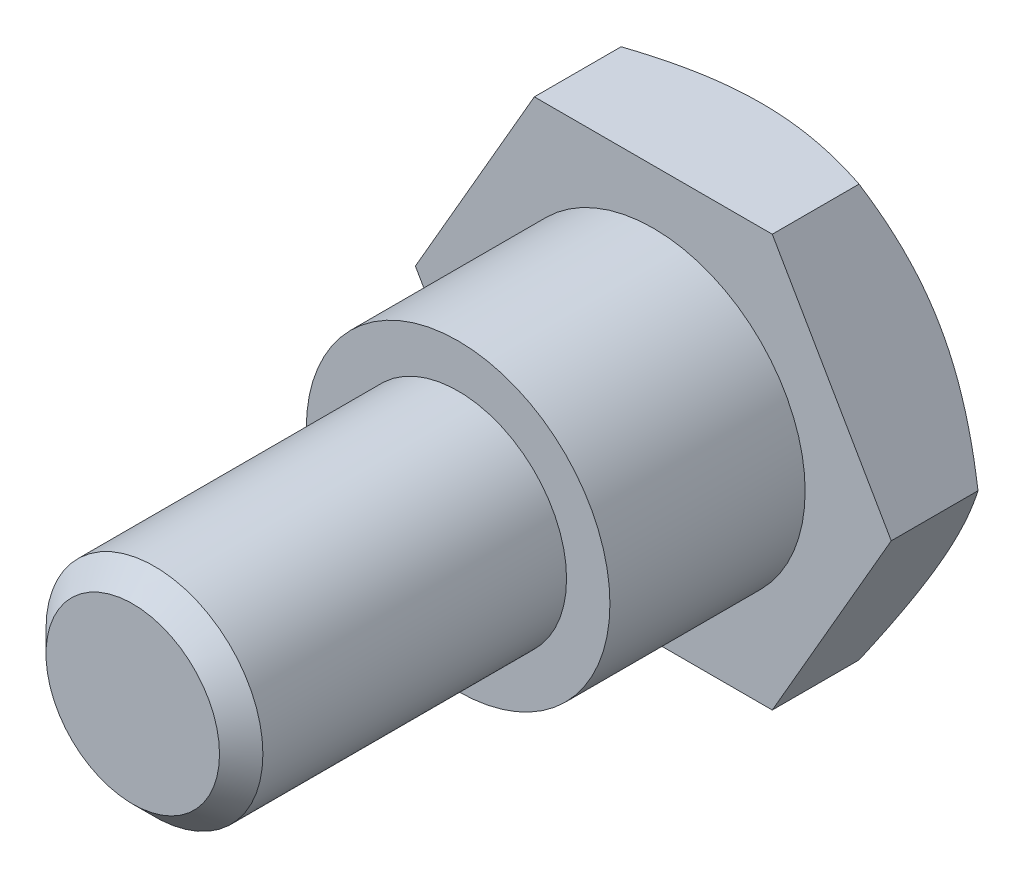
ISO-10303-21;
HEADER;
FILE_DESCRIPTION(('STEP AP214'),'2;1');
FILE_NAME('part.step','',(''),(''),'','','');
FILE_SCHEMA(('AUTOMOTIVE_DESIGN { 1 0 10303 214 1 1 1 1 }'));
ENDSEC;
DATA;
#1=APPLICATION_CONTEXT('core data for automotive mechanical design processes');
#2=APPLICATION_PROTOCOL_DEFINITION('international standard','automotive_design',2000,#1);
#3=PRODUCT_CONTEXT('',#1,'mechanical');
#4=PRODUCT('Part','Part','',(#3));
#5=PRODUCT_RELATED_PRODUCT_CATEGORY('part','',(#4));
#6=PRODUCT_DEFINITION_FORMATION('','',#4);
#7=PRODUCT_DEFINITION_CONTEXT('part definition',#1,'design');
#8=PRODUCT_DEFINITION('design','',#6,#7);
#9=PRODUCT_DEFINITION_SHAPE('','',#8);
#10=(LENGTH_UNIT() NAMED_UNIT(*) SI_UNIT(.MILLI.,.METRE.));
#11=(NAMED_UNIT(*) PLANE_ANGLE_UNIT() SI_UNIT($,.RADIAN.));
#12=(NAMED_UNIT(*) SI_UNIT($,.STERADIAN.) SOLID_ANGLE_UNIT());
#13=UNCERTAINTY_MEASURE_WITH_UNIT(LENGTH_MEASURE(1.E-05),#10,'distance_accuracy_value','');
#14=(GEOMETRIC_REPRESENTATION_CONTEXT(3) GLOBAL_UNCERTAINTY_ASSIGNED_CONTEXT((#13)) GLOBAL_UNIT_ASSIGNED_CONTEXT((#10,
#11,#12)) REPRESENTATION_CONTEXT('',''));
#15=CARTESIAN_POINT('',(0.,0.,0.));
#16=DIRECTION('',(0.,0.,1.));
#17=DIRECTION('',(1.,0.,0.));
#18=AXIS2_PLACEMENT_3D('',#15,#16,#17);
#19=CARTESIAN_POINT('',(5.48482755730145,9.5,29.));
#20=DIRECTION('',(0.,-1.,0.));
#21=DIRECTION('',(1.,0.,0.));
#22=AXIS2_PLACEMENT_3D('',#19,#20,#21);
#23=PLANE('',#22);
#24=CARTESIAN_POINT('',(-13.7339424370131,9.49999999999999,4.8198541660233));
#25=CARTESIAN_POINT('',(-13.5436192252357,9.49999999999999,4.71550593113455));
#26=CARTESIAN_POINT('',(-13.3530021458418,9.49999999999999,4.6116939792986));
#27=CARTESIAN_POINT('',(-12.9711213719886,9.49999999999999,4.40526059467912));
#28=CARTESIAN_POINT('',(-12.7798576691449,9.49999999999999,4.30263917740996));
#29=CARTESIAN_POINT('',(-12.2049445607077,9.49999999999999,3.99670383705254));
#30=CARTESIAN_POINT('',(-11.8202438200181,9.49999999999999,3.79535768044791));
#31=CARTESIAN_POINT('',(-11.0450909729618,9.49999999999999,3.39788198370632));
#32=CARTESIAN_POINT('',(-10.6546179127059,9.5,3.20179320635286));
#33=CARTESIAN_POINT('',(-9.86968730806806,9.5,2.81778716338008));
#34=CARTESIAN_POINT('',(-9.47522999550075,9.5,2.62986942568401));
#35=CARTESIAN_POINT('',(-8.67449029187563,9.5,2.26105592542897));
#36=CARTESIAN_POINT('',(-8.2681224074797,9.5,2.08034477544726));
#37=CARTESIAN_POINT('',(-7.44952568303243,9.5,1.73248678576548));
#38=CARTESIAN_POINT('',(-7.03729614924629,9.5,1.56534156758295));
#39=CARTESIAN_POINT('',(-6.20706952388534,9.5,1.24884915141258));
#40=CARTESIAN_POINT('',(-5.78908780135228,9.5,1.09946207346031));
#41=CARTESIAN_POINT('',(-4.94591208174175,9.5,0.822950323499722));
#42=CARTESIAN_POINT('',(-4.52072054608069,9.5,0.695818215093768));
#43=CARTESIAN_POINT('',(-3.62800538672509,9.5,0.460424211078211));
#44=CARTESIAN_POINT('',(-3.15983959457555,9.5,0.354520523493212));
#45=CARTESIAN_POINT('',(-2.45211687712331,9.5,0.226051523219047));
#46=CARTESIAN_POINT('',(-2.21527591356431,9.5,0.188290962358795));
#47=CARTESIAN_POINT('',(-1.74011644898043,9.5,0.123733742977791));
#48=CARTESIAN_POINT('',(-1.50179815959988,9.5,0.0969355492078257));
#49=CARTESIAN_POINT('',(-1.02623033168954,9.5,0.0551538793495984));
#50=CARTESIAN_POINT('',(-0.788989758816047,9.5,0.0400688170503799));
#51=CARTESIAN_POINT('',(-0.314051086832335,9.5,0.021718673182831));
#52=CARTESIAN_POINT('',(-0.0763529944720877,9.5,0.0184534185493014));
#53=CARTESIAN_POINT('',(0.398860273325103,9.5,0.023831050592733));
#54=CARTESIAN_POINT('',(0.636375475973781,9.5,0.0324715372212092));
#55=CARTESIAN_POINT('',(1.11069159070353,9.5,0.0614237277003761));
#56=CARTESIAN_POINT('',(1.34749247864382,9.5,0.0817358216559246));
#57=CARTESIAN_POINT('',(1.86592634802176,9.5,0.138570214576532));
#58=CARTESIAN_POINT('',(2.1472989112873,9.5,0.177480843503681));
#59=CARTESIAN_POINT('',(2.70760424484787,9.5,0.269951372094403));
#60=CARTESIAN_POINT('',(2.98653680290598,9.5,0.323512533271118));
#61=CARTESIAN_POINT('',(3.81998578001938,9.5,0.504060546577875));
#62=CARTESIAN_POINT('',(4.37028311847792,9.5,0.650807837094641));
#63=CARTESIAN_POINT('',(5.19305542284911,9.5,0.902817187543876));
#64=CARTESIAN_POINT('',(5.47024842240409,9.5,0.993451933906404));
#65=CARTESIAN_POINT('',(6.02159618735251,9.5,1.18368159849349));
#66=CARTESIAN_POINT('',(6.29575067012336,9.5,1.28327734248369));
#67=CARTESIAN_POINT('',(6.83981458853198,9.5,1.48955006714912));
#68=CARTESIAN_POINT('',(7.10973827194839,9.5,1.59618980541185));
#69=CARTESIAN_POINT('',(7.64686899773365,9.5,1.81585567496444));
#70=CARTESIAN_POINT('',(7.91407695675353,9.5,1.92887956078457));
#71=CARTESIAN_POINT('',(8.18010052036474,9.5,2.04456890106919));
#72=B_SPLINE_CURVE_WITH_KNOTS('',3,(#24,#25,#26,#27,#28,#29,#30,#31,#32,#33,#34,#35,#36,#37,#38,
#39,#40,#41,#42,#43,#44,#45,#46,#47,#48,#49,#50,#51,#52,#53,#54,#55,#56,#57,#58,#59,#60,#61,#62,
#63,#64,#65,#66,#67,#68,#69,#70,#71),.UNSPECIFIED.,.F.,.F.,(4,2,2,2,2,2,2,2,2,2,2,2,2,2,2,2,2,2,
2,2,2,2,2,4),(0.,0.651153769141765,1.30231601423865,2.60488241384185,3.91563929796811,
5.22632035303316,6.56033932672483,7.8945175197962,9.22564052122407,10.5563178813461,
11.9946319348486,12.7139153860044,13.4330980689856,14.1459714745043,14.8588344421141,
15.5715537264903,16.2842968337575,17.1359996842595,17.9877758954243,19.6939467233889,
20.5687632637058,21.4436605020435,22.3142541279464,23.1845434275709),.UNSPECIFIED.);
#73=CARTESIAN_POINT('',(-5.48482755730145,9.5,1.));
#74=VERTEX_POINT('',#73);
#75=CARTESIAN_POINT('',(5.48482755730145,9.5,1.));
#76=VERTEX_POINT('',#75);
#77=EDGE_CURVE('E53',#74,#76,#72,.T.);
#78=ORIENTED_EDGE('',*,*,#77,.F.);
#79=DIRECTION('',(0.,0.,-1.));
#80=VECTOR('',#79,1.);
#81=CARTESIAN_POINT('',(-5.48482755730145,9.5,29.));
#82=LINE('',#81,#80);
#83=CARTESIAN_POINT('',(-5.48482755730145,9.5,5.));
#84=VERTEX_POINT('',#83);
#85=EDGE_CURVE('E123',#84,#74,#82,.T.);
#86=ORIENTED_EDGE('',*,*,#85,.F.);
#87=DIRECTION('',(1.,0.,0.));
#88=VECTOR('',#87,1.);
#89=CARTESIAN_POINT('',(5.48482755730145,9.5,5.));
#90=LINE('',#89,#88);
#91=CARTESIAN_POINT('',(5.48482755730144,9.5,5.));
#92=VERTEX_POINT('',#91);
#93=EDGE_CURVE('E114',#84,#92,#90,.T.);
#94=ORIENTED_EDGE('',*,*,#93,.T.);
#95=DIRECTION('',(0.,0.,-1.));
#96=VECTOR('',#95,1.);
#97=CARTESIAN_POINT('',(5.48482755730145,9.5,29.));
#98=LINE('',#97,#96);
#99=EDGE_CURVE('E110',#92,#76,#98,.T.);
#100=ORIENTED_EDGE('',*,*,#99,.T.);
#101=EDGE_LOOP('',(#78,#86,#94,#100));
#102=FACE_BOUND('',#101,.T.);
#103=ADVANCED_FACE('F38',(#102),#23,.F.);
#104=CARTESIAN_POINT('',(-5.48482755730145,9.5,29.));
#105=DIRECTION('',(0.866025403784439,-0.5,0.));
#106=DIRECTION('',(0.5,0.866025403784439,0.));
#107=AXIS2_PLACEMENT_3D('',#104,#105,#106);
#108=PLANE('',#107);
#109=CARTESIAN_POINT('',(-10.9697705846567,-0.000199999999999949,1.00007698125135));
#110=CARTESIAN_POINT('',(-10.8475130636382,0.211556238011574,0.918579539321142));
#111=CARTESIAN_POINT('',(-10.724626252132,0.424402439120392,0.840729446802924));
#112=CARTESIAN_POINT('',(-10.4775192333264,0.85240435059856,0.69343423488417));
#113=CARTESIAN_POINT('',(-10.3532982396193,1.06756142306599,0.623994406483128));
#114=CARTESIAN_POINT('',(-10.1031833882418,1.50077305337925,0.494518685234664));
#115=CARTESIAN_POINT('',(-9.97728532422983,1.71883489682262,0.434515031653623));
#116=CARTESIAN_POINT('',(-9.72434179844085,2.15694593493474,0.325436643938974));
#117=CARTESIAN_POINT('',(-9.59729668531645,2.37699452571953,0.276358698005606));
#118=CARTESIAN_POINT('',(-9.34637592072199,2.81160203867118,0.191694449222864));
#119=CARTESIAN_POINT('',(-9.22253343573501,3.0261035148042,0.155717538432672));
#120=CARTESIAN_POINT('',(-8.9741047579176,3.45639460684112,0.0959709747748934));
#121=CARTESIAN_POINT('',(-8.84951854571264,3.67218425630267,0.0722016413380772));
#122=CARTESIAN_POINT('',(-8.60011147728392,4.10416997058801,0.0375646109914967));
#123=CARTESIAN_POINT('',(-8.47529139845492,4.32036468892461,0.0266746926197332));
#124=CARTESIAN_POINT('',(-8.22554111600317,4.75294486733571,0.0180432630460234));
#125=CARTESIAN_POINT('',(-8.10061091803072,4.96933031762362,0.0203011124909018));
#126=CARTESIAN_POINT('',(-7.87127583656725,5.3665503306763,0.0364633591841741));
#127=CARTESIAN_POINT('',(-7.76683537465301,5.54744651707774,0.0484150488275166));
#128=CARTESIAN_POINT('',(-7.55830198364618,5.90863694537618,0.0812340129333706));
#129=CARTESIAN_POINT('',(-7.4542090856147,6.0889311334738,0.102102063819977));
#130=CARTESIAN_POINT('',(-7.14247471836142,6.62887089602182,0.177574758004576));
#131=CARTESIAN_POINT('',(-6.93558573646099,6.98721312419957,0.245031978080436));
#132=CARTESIAN_POINT('',(-6.51896611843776,7.70881947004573,0.411970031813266));
#133=CARTESIAN_POINT('',(-6.30932537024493,8.07192789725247,0.512317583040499));
#134=CARTESIAN_POINT('',(-5.89408460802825,8.79114599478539,0.738498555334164));
#135=CARTESIAN_POINT('',(-5.6884752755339,9.14727180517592,0.864262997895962));
#136=CARTESIAN_POINT('',(-5.48471208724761,9.5002,1.00007698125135));
#137=B_SPLINE_CURVE_WITH_KNOTS('',3,(#109,#110,#111,#112,#113,#114,#115,#116,#117,#118,#119,
#120,#121,#122,#123,#124,#125,#126,#127,#128,#129,#130,#131,#132,#133,#134,#135,#136),
.UNSPECIFIED.,.F.,.F.,(4,2,2,2,2,2,2,2,2,2,2,2,2,4),(0.,0.773249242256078,1.54698244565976,
2.32330426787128,3.09939757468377,3.84996835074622,4.60055876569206,5.34985225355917,
6.09910930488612,6.7265804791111,7.35410630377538,8.61040386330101,9.90290017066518,
11.191934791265),.UNSPECIFIED.);
#138=CARTESIAN_POINT('',(-10.9696551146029,0.,1.));
#139=VERTEX_POINT('',#138);
#140=EDGE_CURVE('E167',#139,#74,#137,.T.);
#141=ORIENTED_EDGE('',*,*,#140,.F.);
#142=DIRECTION('',(0.,0.,-1.));
#143=VECTOR('',#142,1.);
#144=CARTESIAN_POINT('',(-10.9696551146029,0.,29.));
#145=LINE('',#144,#143);
#146=CARTESIAN_POINT('',(-10.9696551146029,0.,5.));
#147=VERTEX_POINT('',#146);
#148=EDGE_CURVE('E120',#147,#139,#145,.T.);
#149=ORIENTED_EDGE('',*,*,#148,.F.);
#150=DIRECTION('',(0.5,0.866025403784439,0.));
#151=VECTOR('',#150,1.);
#152=CARTESIAN_POINT('',(-5.48482755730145,9.5,5.));
#153=LINE('',#152,#151);
#154=EDGE_CURVE('E331',#147,#84,#153,.T.);
#155=ORIENTED_EDGE('',*,*,#154,.T.);
#156=ORIENTED_EDGE('',*,*,#85,.T.);
#157=EDGE_LOOP('',(#141,#149,#155,#156));
#158=FACE_BOUND('',#157,.T.);
#159=ADVANCED_FACE('F149',(#158),#108,.F.);
#160=CARTESIAN_POINT('',(-10.9696551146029,0.,29.));
#161=DIRECTION('',(0.866025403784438,0.5,0.));
#162=DIRECTION('',(-0.5,0.866025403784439,0.));
#163=AXIS2_PLACEMENT_3D('',#160,#161,#162);
#164=PLANE('',#163);
#165=CARTESIAN_POINT('',(-5.4847120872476,-9.5002,1.00007698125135));
#166=CARTESIAN_POINT('',(-5.60696960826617,-9.28844376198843,0.918579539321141));
#167=CARTESIAN_POINT('',(-5.72985641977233,-9.07559756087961,0.840729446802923));
#168=CARTESIAN_POINT('',(-5.97696343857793,-8.64759564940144,0.693434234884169));
#169=CARTESIAN_POINT('',(-6.10118443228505,-8.43243857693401,0.623994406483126));
#170=CARTESIAN_POINT('',(-6.35129928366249,-7.99922694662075,0.494518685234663));
#171=CARTESIAN_POINT('',(-6.4771973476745,-7.78116510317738,0.434515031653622));
#172=CARTESIAN_POINT('',(-6.73014087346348,-7.34305406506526,0.325436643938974));
#173=CARTESIAN_POINT('',(-6.85718598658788,-7.12300547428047,0.276358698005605));
#174=CARTESIAN_POINT('',(-7.10810675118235,-6.68839796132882,0.191694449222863));
#175=CARTESIAN_POINT('',(-7.23194923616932,-6.4738964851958,0.155717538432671));
#176=CARTESIAN_POINT('',(-7.48037791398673,-6.04360539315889,0.0959709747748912));
#177=CARTESIAN_POINT('',(-7.60496412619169,-5.82781574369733,0.0722016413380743));
#178=CARTESIAN_POINT('',(-7.85437119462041,-5.39583002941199,0.0375646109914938));
#179=CARTESIAN_POINT('',(-7.97919127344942,-5.1796353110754,0.0266746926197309));
#180=CARTESIAN_POINT('',(-8.22894155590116,-4.7470551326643,0.018043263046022));
#181=CARTESIAN_POINT('',(-8.35387175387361,-4.53066968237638,0.0203011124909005));
#182=CARTESIAN_POINT('',(-8.58320683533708,-4.1334496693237,0.0364633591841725));
#183=CARTESIAN_POINT('',(-8.68764729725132,-3.95255348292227,0.0484150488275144));
#184=CARTESIAN_POINT('',(-8.89618068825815,-3.59136305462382,0.0812340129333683));
#185=CARTESIAN_POINT('',(-9.00027358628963,-3.41106886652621,0.102102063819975));
#186=CARTESIAN_POINT('',(-9.31200795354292,-2.87112910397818,0.177574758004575));
#187=CARTESIAN_POINT('',(-9.51889693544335,-2.51278687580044,0.245031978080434));
#188=CARTESIAN_POINT('',(-9.93551655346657,-1.79118052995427,0.411970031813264));
#189=CARTESIAN_POINT('',(-10.1451573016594,-1.42807210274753,0.512317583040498));
#190=CARTESIAN_POINT('',(-10.5603980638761,-0.708854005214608,0.738498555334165));
#191=CARTESIAN_POINT('',(-10.7660073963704,-0.352728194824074,0.864262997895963));
#192=CARTESIAN_POINT('',(-10.9697705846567,0.000199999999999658,1.00007698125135));
#193=B_SPLINE_CURVE_WITH_KNOTS('',3,(#165,#166,#167,#168,#169,#170,#171,#172,#173,#174,#175,
#176,#177,#178,#179,#180,#181,#182,#183,#184,#185,#186,#187,#188,#189,#190,#191,#192),
.UNSPECIFIED.,.F.,.F.,(4,2,2,2,2,2,2,2,2,2,2,2,2,4),(0.,0.773249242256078,1.54698244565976,
2.32330426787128,3.09939757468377,3.84996835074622,4.60055876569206,5.34985225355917,
6.09910930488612,6.7265804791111,7.35410630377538,8.61040386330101,9.90290017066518,
11.191934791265),.UNSPECIFIED.);
#194=CARTESIAN_POINT('',(-5.48482755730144,-9.5,1.));
#195=VERTEX_POINT('',#194);
#196=EDGE_CURVE('E199',#195,#139,#193,.T.);
#197=ORIENTED_EDGE('',*,*,#196,.F.);
#198=DIRECTION('',(0.,0.,-1.));
#199=VECTOR('',#198,1.);
#200=CARTESIAN_POINT('',(-5.48482755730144,-9.5,29.));
#201=LINE('',#200,#199);
#202=CARTESIAN_POINT('',(-5.48482755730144,-9.5,5.));
#203=VERTEX_POINT('',#202);
#204=EDGE_CURVE('E112',#203,#195,#201,.T.);
#205=ORIENTED_EDGE('',*,*,#204,.F.);
#206=DIRECTION('',(-0.5,0.866025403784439,0.));
#207=VECTOR('',#206,1.);
#208=CARTESIAN_POINT('',(-10.9696551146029,0.,5.));
#209=LINE('',#208,#207);
#210=EDGE_CURVE('E328',#203,#147,#209,.T.);
#211=ORIENTED_EDGE('',*,*,#210,.T.);
#212=ORIENTED_EDGE('',*,*,#148,.T.);
#213=EDGE_LOOP('',(#197,#205,#211,#212));
#214=FACE_BOUND('',#213,.T.);
#215=ADVANCED_FACE('F154',(#214),#164,.F.);
#216=CARTESIAN_POINT('',(-5.48482755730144,-9.5,29.));
#217=DIRECTION('',(0.,1.,0.));
#218=DIRECTION('',(-1.,0.,0.));
#219=AXIS2_PLACEMENT_3D('',#216,#217,#218);
#220=PLANE('',#219);
#221=CARTESIAN_POINT('',(-13.7339424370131,-9.5,4.81985416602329));
#222=CARTESIAN_POINT('',(-13.5436192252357,-9.5,4.71550593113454));
#223=CARTESIAN_POINT('',(-13.3530021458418,-9.5,4.61169397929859));
#224=CARTESIAN_POINT('',(-12.9711213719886,-9.5,4.40526059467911));
#225=CARTESIAN_POINT('',(-12.7798576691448,-9.5,4.30263917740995));
#226=CARTESIAN_POINT('',(-12.2049445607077,-9.5,3.99670383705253));
#227=CARTESIAN_POINT('',(-11.8202438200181,-9.5,3.7953576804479));
#228=CARTESIAN_POINT('',(-11.0450909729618,-9.5,3.39788198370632));
#229=CARTESIAN_POINT('',(-10.6546179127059,-9.5,3.20179320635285));
#230=CARTESIAN_POINT('',(-9.86968730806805,-9.5,2.81778716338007));
#231=CARTESIAN_POINT('',(-9.47522999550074,-9.5,2.62986942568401));
#232=CARTESIAN_POINT('',(-8.67449029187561,-9.5,2.26105592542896));
#233=CARTESIAN_POINT('',(-8.26812240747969,-9.5,2.08034477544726));
#234=CARTESIAN_POINT('',(-7.44952568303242,-9.5,1.73248678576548));
#235=CARTESIAN_POINT('',(-7.03729614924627,-9.5,1.56534156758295));
#236=CARTESIAN_POINT('',(-6.20706952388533,-9.5,1.24884915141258));
#237=CARTESIAN_POINT('',(-5.78908780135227,-9.5,1.09946207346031));
#238=CARTESIAN_POINT('',(-4.94591208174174,-9.5,0.822950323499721));
#239=CARTESIAN_POINT('',(-4.52072054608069,-9.5,0.695818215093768));
#240=CARTESIAN_POINT('',(-3.62800538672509,-9.5,0.460424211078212));
#241=CARTESIAN_POINT('',(-3.15983959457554,-9.5,0.354520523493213));
#242=CARTESIAN_POINT('',(-2.4521168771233,-9.5,0.226051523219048));
#243=CARTESIAN_POINT('',(-2.2152759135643,-9.5,0.188290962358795));
#244=CARTESIAN_POINT('',(-1.74011644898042,-9.5,0.123733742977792));
#245=CARTESIAN_POINT('',(-1.50179815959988,-9.5,0.096935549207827));
#246=CARTESIAN_POINT('',(-1.02623033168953,-9.5,0.0551538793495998));
#247=CARTESIAN_POINT('',(-0.78898975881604,-9.5,0.0400688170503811));
#248=CARTESIAN_POINT('',(-0.314051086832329,-9.5,0.0217186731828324));
#249=CARTESIAN_POINT('',(-0.0763529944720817,-9.5,0.0184534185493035));
#250=CARTESIAN_POINT('',(0.398860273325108,-9.5,0.0238310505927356));
#251=CARTESIAN_POINT('',(0.636375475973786,-9.5,0.0324715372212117));
#252=CARTESIAN_POINT('',(1.11069159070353,-9.5,0.061423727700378));
#253=CARTESIAN_POINT('',(1.34749247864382,-9.5,0.0817358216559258));
#254=CARTESIAN_POINT('',(1.86592634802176,-9.5,0.138570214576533));
#255=CARTESIAN_POINT('',(2.14729891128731,-9.5,0.177480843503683));
#256=CARTESIAN_POINT('',(2.70760424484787,-9.5,0.269951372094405));
#257=CARTESIAN_POINT('',(2.98653680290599,-9.5,0.323512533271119));
#258=CARTESIAN_POINT('',(3.81998578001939,-9.5,0.504060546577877));
#259=CARTESIAN_POINT('',(4.37028311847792,-9.5,0.650807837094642));
#260=CARTESIAN_POINT('',(5.19305542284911,-9.5,0.902817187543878));
#261=CARTESIAN_POINT('',(5.47024842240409,-9.5,0.993451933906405));
#262=CARTESIAN_POINT('',(6.02159618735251,-9.5,1.18368159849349));
#263=CARTESIAN_POINT('',(6.29575067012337,-9.5,1.28327734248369));
#264=CARTESIAN_POINT('',(6.83981458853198,-9.5,1.48955006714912));
#265=CARTESIAN_POINT('',(7.1097382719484,-9.5,1.59618980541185));
#266=CARTESIAN_POINT('',(7.64686899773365,-9.5,1.81585567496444));
#267=CARTESIAN_POINT('',(7.91407695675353,-9.5,1.92887956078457));
#268=CARTESIAN_POINT('',(8.18010052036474,-9.5,2.04456890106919));
#269=B_SPLINE_CURVE_WITH_KNOTS('',3,(#221,#222,#223,#224,#225,#226,#227,#228,#229,#230,#231,
#232,#233,#234,#235,#236,#237,#238,#239,#240,#241,#242,#243,#244,#245,#246,#247,#248,#249,#250,
#251,#252,#253,#254,#255,#256,#257,#258,#259,#260,#261,#262,#263,#264,#265,#266,#267,#268),
.UNSPECIFIED.,.F.,.F.,(4,2,2,2,2,2,2,2,2,2,2,2,2,2,2,2,2,2,2,2,2,2,2,4),(0.,0.651153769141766,
1.30231601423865,2.60488241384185,3.9156392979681,5.22632035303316,6.56033932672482,
7.89451751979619,9.22564052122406,10.556317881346,11.9946319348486,12.7139153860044,
13.4330980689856,14.1459714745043,14.8588344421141,15.5715537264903,16.2842968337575,
17.1359996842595,17.9877758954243,19.6939467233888,20.5687632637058,21.4436605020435,
22.3142541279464,23.1845434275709),.UNSPECIFIED.);
#270=CARTESIAN_POINT('',(5.48482755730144,-9.5,1.));
#271=VERTEX_POINT('',#270);
#272=EDGE_CURVE('E106',#271,#195,#269,.F.);
#273=ORIENTED_EDGE('',*,*,#272,.F.);
#274=DIRECTION('',(0.,0.,-1.));
#275=VECTOR('',#274,1.);
#276=CARTESIAN_POINT('',(5.48482755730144,-9.5,29.));
#277=LINE('',#276,#275);
#278=CARTESIAN_POINT('',(5.48482755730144,-9.5,5.));
#279=VERTEX_POINT('',#278);
#280=EDGE_CURVE('E105',#279,#271,#277,.T.);
#281=ORIENTED_EDGE('',*,*,#280,.F.);
#282=DIRECTION('',(-1.,0.,0.));
#283=VECTOR('',#282,1.);
#284=CARTESIAN_POINT('',(-5.48482755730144,-9.5,5.));
#285=LINE('',#284,#283);
#286=EDGE_CURVE('E323',#279,#203,#285,.T.);
#287=ORIENTED_EDGE('',*,*,#286,.T.);
#288=ORIENTED_EDGE('',*,*,#204,.T.);
#289=EDGE_LOOP('',(#273,#281,#287,#288));
#290=FACE_BOUND('',#289,.T.);
#291=ADVANCED_FACE('F206',(#290),#220,.F.);
#292=CARTESIAN_POINT('',(5.48482755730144,-9.5,29.));
#293=DIRECTION('',(-0.866025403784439,0.5,0.));
#294=DIRECTION('',(-0.5,-0.866025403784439,0.));
#295=AXIS2_PLACEMENT_3D('',#292,#293,#294);
#296=PLANE('',#295);
#297=CARTESIAN_POINT('',(10.9697705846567,0.000200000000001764,1.00007698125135));
#298=CARTESIAN_POINT('',(10.8475130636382,-0.211556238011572,0.918579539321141));
#299=CARTESIAN_POINT('',(10.724626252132,-0.424402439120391,0.840729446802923));
#300=CARTESIAN_POINT('',(10.4775192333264,-0.852404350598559,0.693434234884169));
#301=CARTESIAN_POINT('',(10.3532982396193,-1.06756142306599,0.623994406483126));
#302=CARTESIAN_POINT('',(10.1031833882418,-1.50077305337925,0.494518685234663));
#303=CARTESIAN_POINT('',(9.97728532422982,-1.71883489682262,0.434515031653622));
#304=CARTESIAN_POINT('',(9.72434179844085,-2.15694593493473,0.325436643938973));
#305=CARTESIAN_POINT('',(9.59729668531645,-2.37699452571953,0.276358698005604));
#306=CARTESIAN_POINT('',(9.34637592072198,-2.81160203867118,0.191694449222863));
#307=CARTESIAN_POINT('',(9.22253343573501,-3.0261035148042,0.155717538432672));
#308=CARTESIAN_POINT('',(8.9741047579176,-3.45639460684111,0.0959709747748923));
#309=CARTESIAN_POINT('',(8.84951854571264,-3.67218425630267,0.0722016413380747));
#310=CARTESIAN_POINT('',(8.60011147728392,-4.10416997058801,0.037564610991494));
#311=CARTESIAN_POINT('',(8.47529139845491,-4.3203646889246,0.0266746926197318));
#312=CARTESIAN_POINT('',(8.22554111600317,-4.7529448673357,0.0180432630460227));
#313=CARTESIAN_POINT('',(8.10061091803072,-4.96933031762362,0.0203011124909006));
#314=CARTESIAN_POINT('',(7.87127583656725,-5.3665503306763,0.0364633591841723));
#315=CARTESIAN_POINT('',(7.766835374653,-5.54744651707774,0.0484150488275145));
#316=CARTESIAN_POINT('',(7.55830198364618,-5.90863694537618,0.0812340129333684));
#317=CARTESIAN_POINT('',(7.4542090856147,-6.0889311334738,0.102102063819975));
#318=CARTESIAN_POINT('',(7.14247471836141,-6.62887089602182,0.177574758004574));
#319=CARTESIAN_POINT('',(6.93558573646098,-6.98721312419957,0.245031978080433));
#320=CARTESIAN_POINT('',(6.51896611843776,-7.70881947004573,0.411970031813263));
#321=CARTESIAN_POINT('',(6.30932537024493,-8.07192789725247,0.512317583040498));
#322=CARTESIAN_POINT('',(5.89408460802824,-8.79114599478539,0.738498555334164));
#323=CARTESIAN_POINT('',(5.68847527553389,-9.14727180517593,0.864262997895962));
#324=CARTESIAN_POINT('',(5.4847120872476,-9.5002,1.00007698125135));
#325=B_SPLINE_CURVE_WITH_KNOTS('',3,(#297,#298,#299,#300,#301,#302,#303,#304,#305,#306,#307,
#308,#309,#310,#311,#312,#313,#314,#315,#316,#317,#318,#319,#320,#321,#322,#323,#324),
.UNSPECIFIED.,.F.,.F.,(4,2,2,2,2,2,2,2,2,2,2,2,2,4),(0.,0.773249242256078,1.54698244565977,
2.32330426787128,3.09939757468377,3.84996835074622,4.60055876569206,5.34985225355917,
6.09910930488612,6.7265804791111,7.35410630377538,8.61040386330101,9.90290017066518,
11.191934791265),.UNSPECIFIED.);
#326=CARTESIAN_POINT('',(10.9696551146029,0.,1.));
#327=VERTEX_POINT('',#326);
#328=EDGE_CURVE('E91',#327,#271,#325,.T.);
#329=ORIENTED_EDGE('',*,*,#328,.F.);
#330=DIRECTION('',(0.,0.,-1.));
#331=VECTOR('',#330,1.);
#332=CARTESIAN_POINT('',(10.9696551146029,0.,29.));
#333=LINE('',#332,#331);
#334=CARTESIAN_POINT('',(10.9696551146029,0.,5.00000000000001));
#335=VERTEX_POINT('',#334);
#336=EDGE_CURVE('E103',#335,#327,#333,.T.);
#337=ORIENTED_EDGE('',*,*,#336,.F.);
#338=DIRECTION('',(-0.5,-0.866025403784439,0.));
#339=VECTOR('',#338,1.);
#340=CARTESIAN_POINT('',(5.48482755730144,-9.5,5.));
#341=LINE('',#340,#339);
#342=EDGE_CURVE('E61',#335,#279,#341,.T.);
#343=ORIENTED_EDGE('',*,*,#342,.T.);
#344=ORIENTED_EDGE('',*,*,#280,.T.);
#345=EDGE_LOOP('',(#329,#337,#343,#344));
#346=FACE_BOUND('',#345,.T.);
#347=ADVANCED_FACE('F102',(#346),#296,.F.);
#348=CARTESIAN_POINT('',(10.9696551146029,0.,29.));
#349=DIRECTION('',(-0.866025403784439,-0.5,0.));
#350=DIRECTION('',(0.5,-0.866025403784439,0.));
#351=AXIS2_PLACEMENT_3D('',#348,#349,#350);
#352=PLANE('',#351);
#353=CARTESIAN_POINT('',(5.48471208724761,9.5002,1.00007698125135));
#354=CARTESIAN_POINT('',(5.60696960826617,9.28844376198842,0.91857953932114));
#355=CARTESIAN_POINT('',(5.72985641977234,9.07559756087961,0.840729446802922));
#356=CARTESIAN_POINT('',(5.97696343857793,8.64759564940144,0.693434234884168));
#357=CARTESIAN_POINT('',(6.10118443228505,8.43243857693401,0.623994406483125));
#358=CARTESIAN_POINT('',(6.35129928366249,7.99922694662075,0.494518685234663));
#359=CARTESIAN_POINT('',(6.47719734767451,7.78116510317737,0.434515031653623));
#360=CARTESIAN_POINT('',(6.73014087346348,7.34305406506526,0.325436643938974));
#361=CARTESIAN_POINT('',(6.85718598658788,7.12300547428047,0.276358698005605));
#362=CARTESIAN_POINT('',(7.10810675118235,6.68839796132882,0.191694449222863));
#363=CARTESIAN_POINT('',(7.23194923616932,6.4738964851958,0.155717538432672));
#364=CARTESIAN_POINT('',(7.48037791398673,6.04360539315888,0.0959709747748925));
#365=CARTESIAN_POINT('',(7.6049641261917,5.82781574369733,0.0722016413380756));
#366=CARTESIAN_POINT('',(7.85437119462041,5.39583002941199,0.0375646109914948));
#367=CARTESIAN_POINT('',(7.97919127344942,5.17963531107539,0.0266746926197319));
#368=CARTESIAN_POINT('',(8.22894155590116,4.74705513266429,0.0180432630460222));
#369=CARTESIAN_POINT('',(8.35387175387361,4.53066968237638,0.0203011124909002));
#370=CARTESIAN_POINT('',(8.58320683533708,4.1334496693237,0.0364633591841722));
#371=CARTESIAN_POINT('',(8.68764729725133,3.95255348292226,0.0484150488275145));
#372=CARTESIAN_POINT('',(8.89618068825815,3.59136305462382,0.0812340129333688));
#373=CARTESIAN_POINT('',(9.00027358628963,3.4110688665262,0.102102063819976));
#374=CARTESIAN_POINT('',(9.31200795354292,2.87112910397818,0.177574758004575));
#375=CARTESIAN_POINT('',(9.51889693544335,2.51278687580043,0.245031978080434));
#376=CARTESIAN_POINT('',(9.93551655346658,1.79118052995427,0.411970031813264));
#377=CARTESIAN_POINT('',(10.1451573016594,1.42807210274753,0.512317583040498));
#378=CARTESIAN_POINT('',(10.5603980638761,0.708854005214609,0.738498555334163));
#379=CARTESIAN_POINT('',(10.7660073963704,0.352728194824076,0.864262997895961));
#380=CARTESIAN_POINT('',(10.9697705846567,-0.000199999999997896,1.00007698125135));
#381=B_SPLINE_CURVE_WITH_KNOTS('',3,(#353,#354,#355,#356,#357,#358,#359,#360,#361,#362,#363,
#364,#365,#366,#367,#368,#369,#370,#371,#372,#373,#374,#375,#376,#377,#378,#379,#380),
.UNSPECIFIED.,.F.,.F.,(4,2,2,2,2,2,2,2,2,2,2,2,2,4),(0.,0.773249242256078,1.54698244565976,
2.32330426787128,3.09939757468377,3.84996835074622,4.60055876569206,5.34985225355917,
6.09910930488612,6.7265804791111,7.35410630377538,8.61040386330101,9.90290017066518,
11.191934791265),.UNSPECIFIED.);
#382=EDGE_CURVE('E88',#76,#327,#381,.T.);
#383=ORIENTED_EDGE('',*,*,#382,.F.);
#384=ORIENTED_EDGE('',*,*,#99,.F.);
#385=DIRECTION('',(0.5,-0.866025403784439,0.));
#386=VECTOR('',#385,1.);
#387=CARTESIAN_POINT('',(10.9696551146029,0.,5.));
#388=LINE('',#387,#386);
#389=EDGE_CURVE('E109',#92,#335,#388,.T.);
#390=ORIENTED_EDGE('',*,*,#389,.T.);
#391=ORIENTED_EDGE('',*,*,#336,.T.);
#392=EDGE_LOOP('',(#383,#384,#390,#391));
#393=FACE_BOUND('',#392,.T.);
#394=ADVANCED_FACE('F108',(#393),#352,.F.);
#395=CARTESIAN_POINT('',(0.,0.,37.));
#396=DIRECTION('',(0.,0.,-1.));
#397=DIRECTION('',(-1.,0.,0.));
#398=AXIS2_PLACEMENT_3D('',#395,#396,#397);
#399=CYLINDRICAL_SURFACE('',#398,7.);
#400=CARTESIAN_POINT('',(0.,0.,5.));
#401=DIRECTION('',(0.,0.,-1.));
#402=DIRECTION('',(-1.,0.,0.));
#403=AXIS2_PLACEMENT_3D('',#400,#401,#402);
#404=CIRCLE('',#403,7.);
#405=CARTESIAN_POINT('',(-7.,0.,5.));
#406=VERTEX_POINT('',#405);
#407=EDGE_CURVE('E129',#406,#406,#404,.T.);
#408=ORIENTED_EDGE('',*,*,#407,.F.);
#409=EDGE_LOOP('',(#408));
#410=FACE_BOUND('',#409,.T.);
#411=CARTESIAN_POINT('',(0.,0.,14.));
#412=DIRECTION('',(0.,0.,1.));
#413=DIRECTION('',(1.,0.,0.));
#414=AXIS2_PLACEMENT_3D('',#411,#412,#413);
#415=CIRCLE('',#414,7.);
#416=CARTESIAN_POINT('',(7.,0.,14.));
#417=VERTEX_POINT('',#416);
#418=EDGE_CURVE('E127',#417,#417,#415,.F.);
#419=ORIENTED_EDGE('',*,*,#418,.T.);
#420=EDGE_LOOP('',(#419));
#421=FACE_BOUND('',#420,.T.);
#422=ADVANCED_FACE('F216',(#410,#421),#399,.T.);
#423=CARTESIAN_POINT('',(0.,0.,5.));
#424=DIRECTION('',(0.,0.,-1.));
#425=DIRECTION('',(-1.,0.,0.));
#426=AXIS2_PLACEMENT_3D('',#423,#424,#425);
#427=PLANE('',#426);
#428=ORIENTED_EDGE('',*,*,#407,.T.);
#429=EDGE_LOOP('',(#428));
#430=FACE_BOUND('',#429,.T.);
#431=ORIENTED_EDGE('',*,*,#154,.F.);
#432=ORIENTED_EDGE('',*,*,#210,.F.);
#433=ORIENTED_EDGE('',*,*,#286,.F.);
#434=ORIENTED_EDGE('',*,*,#342,.F.);
#435=ORIENTED_EDGE('',*,*,#389,.F.);
#436=ORIENTED_EDGE('',*,*,#93,.F.);
#437=EDGE_LOOP('',(#431,#432,#433,#434,#435,#436));
#438=FACE_BOUND('',#437,.T.);
#439=ADVANCED_FACE('F220',(#430,#438),#427,.F.);
#440=CARTESIAN_POINT('',(0.,0.,14.));
#441=DIRECTION('',(0.,0.,1.));
#442=DIRECTION('',(1.,0.,0.));
#443=AXIS2_PLACEMENT_3D('',#440,#441,#442);
#444=PLANE('',#443);
#445=ORIENTED_EDGE('',*,*,#418,.F.);
#446=EDGE_LOOP('',(#445));
#447=FACE_BOUND('',#446,.T.);
#448=CARTESIAN_POINT('',(0.,0.,14.));
#449=DIRECTION('',(0.,0.,1.));
#450=DIRECTION('',(1.,0.,0.));
#451=AXIS2_PLACEMENT_3D('',#448,#449,#450);
#452=CIRCLE('',#451,5.);
#453=CARTESIAN_POINT('',(5.,0.,14.));
#454=VERTEX_POINT('',#453);
#455=EDGE_CURVE('E130',#454,#454,#452,.T.);
#456=ORIENTED_EDGE('',*,*,#455,.F.);
#457=EDGE_LOOP('',(#456));
#458=FACE_BOUND('',#457,.T.);
#459=ADVANCED_FACE('F223',(#447,#458),#444,.T.);
#460=CARTESIAN_POINT('',(0.,0.,14.));
#461=DIRECTION('',(0.,0.,1.));
#462=DIRECTION('',(1.,0.,0.));
#463=AXIS2_PLACEMENT_3D('',#460,#461,#462);
#464=CYLINDRICAL_SURFACE('',#463,5.);
#465=CARTESIAN_POINT('',(0.,0.,28.));
#466=DIRECTION('',(0.,0.,1.));
#467=DIRECTION('',(1.,0.,0.));
#468=AXIS2_PLACEMENT_3D('',#465,#466,#467);
#469=CIRCLE('',#468,5.);
#470=CARTESIAN_POINT('',(5.,0.,28.));
#471=VERTEX_POINT('',#470);
#472=EDGE_CURVE('E12',#471,#471,#469,.F.);
#473=ORIENTED_EDGE('',*,*,#472,.T.);
#474=EDGE_LOOP('',(#473));
#475=FACE_BOUND('',#474,.T.);
#476=ORIENTED_EDGE('',*,*,#455,.T.);
#477=EDGE_LOOP('',(#476));
#478=FACE_BOUND('',#477,.T.);
#479=ADVANCED_FACE('F145',(#475,#478),#464,.T.);
#480=CARTESIAN_POINT('',(-5.48482755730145,9.49999999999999,29.));
#481=DIRECTION('',(0.,0.,1.));
#482=DIRECTION('',(1.,0.,0.));
#483=AXIS2_PLACEMENT_3D('',#480,#481,#482);
#484=PLANE('',#483);
#485=CARTESIAN_POINT('',(0.,0.,29.));
#486=DIRECTION('',(0.,0.,1.));
#487=DIRECTION('',(1.,0.,0.));
#488=AXIS2_PLACEMENT_3D('',#485,#486,#487);
#489=CIRCLE('',#488,4.);
#490=CARTESIAN_POINT('',(4.,0.,29.));
#491=VERTEX_POINT('',#490);
#492=EDGE_CURVE('E46',#491,#491,#489,.T.);
#493=ORIENTED_EDGE('',*,*,#492,.T.);
#494=EDGE_LOOP('',(#493));
#495=FACE_BOUND('',#494,.T.);
#496=ADVANCED_FACE('F134',(#495),#484,.T.);
#497=CARTESIAN_POINT('',(0.,0.,29.));
#498=DIRECTION('',(0.,0.,-1.));
#499=DIRECTION('',(-1.,0.,0.));
#500=AXIS2_PLACEMENT_3D('',#497,#498,#499);
#501=CONICAL_SURFACE('',#500,4.,0.785398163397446);
#502=ORIENTED_EDGE('',*,*,#472,.F.);
#503=EDGE_LOOP('',(#502));
#504=FACE_BOUND('',#503,.T.);
#505=ORIENTED_EDGE('',*,*,#492,.F.);
#506=EDGE_LOOP('',(#505));
#507=FACE_BOUND('',#506,.T.);
#508=ADVANCED_FACE('F40',(#504,#507),#501,.T.);
#509=CARTESIAN_POINT('',(0.,0.,1.));
#510=DIRECTION('',(0.,0.,1.));
#511=DIRECTION('',(1.,0.,0.));
#512=AXIS2_PLACEMENT_3D('',#509,#510,#511);
#513=CONICAL_SURFACE('',#512,10.9696551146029,0.982793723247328);
#514=CARTESIAN_POINT('',(0.,0.,0.));
#515=DIRECTION('',(0.,0.,1.));
#516=DIRECTION('',(1.,0.,0.));
#517=AXIS2_PLACEMENT_3D('',#514,#515,#516);
#518=CIRCLE('',#517,9.46965511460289);
#519=CARTESIAN_POINT('',(9.46965511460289,0.,0.));
#520=VERTEX_POINT('',#519);
#521=EDGE_CURVE('E97',#520,#520,#518,.T.);
#522=ORIENTED_EDGE('',*,*,#521,.T.);
#523=EDGE_LOOP('',(#522));
#524=FACE_BOUND('',#523,.T.);
#525=ORIENTED_EDGE('',*,*,#77,.T.);
#526=ORIENTED_EDGE('',*,*,#382,.T.);
#527=ORIENTED_EDGE('',*,*,#328,.T.);
#528=ORIENTED_EDGE('',*,*,#272,.T.);
#529=ORIENTED_EDGE('',*,*,#196,.T.);
#530=ORIENTED_EDGE('',*,*,#140,.T.);
#531=EDGE_LOOP('',(#525,#526,#527,#528,#529,#530));
#532=FACE_BOUND('',#531,.T.);
#533=ADVANCED_FACE('F90',(#524,#532),#513,.T.);
#534=CARTESIAN_POINT('',(-5.48482755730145,9.49999999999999,0.));
#535=DIRECTION('',(0.,0.,1.));
#536=DIRECTION('',(1.,0.,0.));
#537=AXIS2_PLACEMENT_3D('',#534,#535,#536);
#538=PLANE('',#537);
#539=ORIENTED_EDGE('',*,*,#521,.F.);
#540=EDGE_LOOP('',(#539));
#541=FACE_BOUND('',#540,.T.);
#542=ADVANCED_FACE('F142',(#541),#538,.F.);
#543=CLOSED_SHELL('',(#103,#159,#215,#291,#347,#394,#422,#439,#459,#479,#496,#508,#533,#542));
#544=MANIFOLD_SOLID_BREP('B2',#543);
#545=ADVANCED_BREP_SHAPE_REPRESENTATION('',(#18,#544),#14);
#546=SHAPE_DEFINITION_REPRESENTATION(#9,#545);
ENDSEC;
END-ISO-10303-21;
